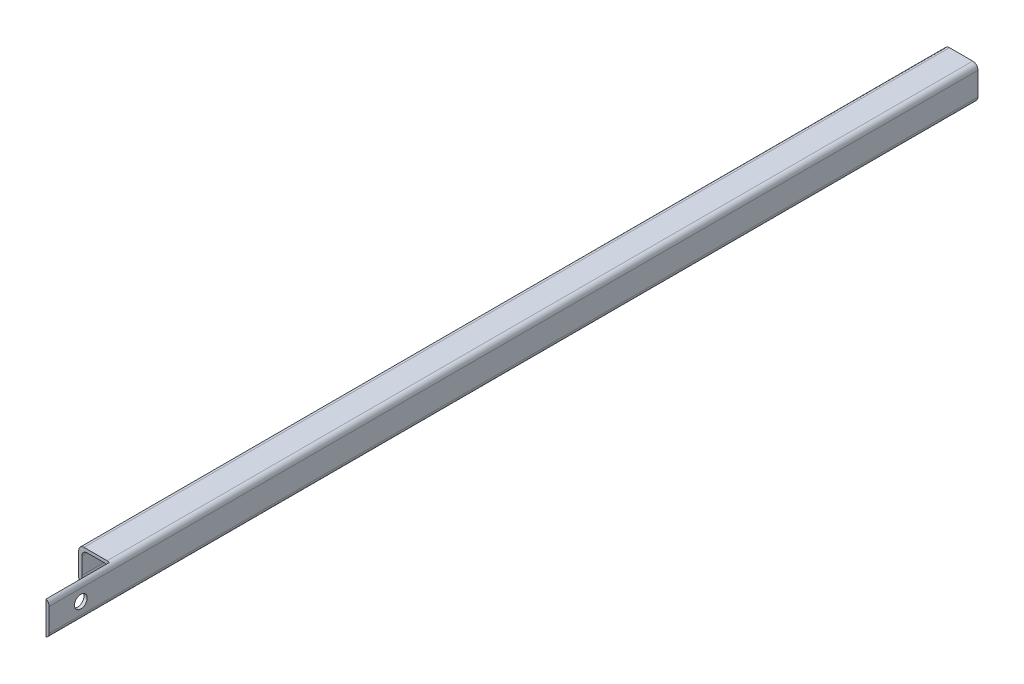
ISO-10303-21;
HEADER;
FILE_DESCRIPTION(('STEP AP214'),'2;1');
FILE_NAME('part.step','',(''),(''),'','','');
FILE_SCHEMA(('AUTOMOTIVE_DESIGN { 1 0 10303 214 1 1 1 1 }'));
ENDSEC;
DATA;
#1=APPLICATION_CONTEXT('core data for automotive mechanical design processes');
#2=APPLICATION_PROTOCOL_DEFINITION('international standard','automotive_design',2000,#1);
#3=PRODUCT_CONTEXT('',#1,'mechanical');
#4=PRODUCT('Part','Part','',(#3));
#5=PRODUCT_RELATED_PRODUCT_CATEGORY('part','',(#4));
#6=PRODUCT_DEFINITION_FORMATION('','',#4);
#7=PRODUCT_DEFINITION_CONTEXT('part definition',#1,'design');
#8=PRODUCT_DEFINITION('design','',#6,#7);
#9=PRODUCT_DEFINITION_SHAPE('','',#8);
#10=(LENGTH_UNIT() NAMED_UNIT(*) SI_UNIT(.MILLI.,.METRE.));
#11=(NAMED_UNIT(*) PLANE_ANGLE_UNIT() SI_UNIT($,.RADIAN.));
#12=(NAMED_UNIT(*) SI_UNIT($,.STERADIAN.) SOLID_ANGLE_UNIT());
#13=UNCERTAINTY_MEASURE_WITH_UNIT(LENGTH_MEASURE(1.E-05),#10,'distance_accuracy_value','');
#14=(GEOMETRIC_REPRESENTATION_CONTEXT(3) GLOBAL_UNCERTAINTY_ASSIGNED_CONTEXT((#13)) GLOBAL_UNIT_ASSIGNED_CONTEXT((#10,
#11,#12)) REPRESENTATION_CONTEXT('',''));
#15=CARTESIAN_POINT('',(0.,0.,0.));
#16=DIRECTION('',(0.,0.,1.));
#17=DIRECTION('',(1.,0.,0.));
#18=AXIS2_PLACEMENT_3D('',#15,#16,#17);
#19=CARTESIAN_POINT('',(7.99999999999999,-5.5,440.));
#20=DIRECTION('',(-1.,0.,0.));
#21=DIRECTION('',(0.,0.,1.));
#22=AXIS2_PLACEMENT_3D('',#19,#20,#21);
#23=PLANE('',#22);
#24=DIRECTION('',(0.,1.,0.));
#25=VECTOR('',#24,1.);
#26=CARTESIAN_POINT('',(7.99999999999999,-5.5,0.));
#27=LINE('',#26,#25);
#28=CARTESIAN_POINT('',(7.99999999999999,-5.5,0.));
#29=VERTEX_POINT('',#28);
#30=CARTESIAN_POINT('',(7.99999999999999,5.5,0.));
#31=VERTEX_POINT('',#30);
#32=EDGE_CURVE('E207',#29,#31,#27,.T.);
#33=ORIENTED_EDGE('',*,*,#32,.T.);
#34=DIRECTION('',(0.,0.,-1.));
#35=VECTOR('',#34,1.);
#36=CARTESIAN_POINT('',(7.99999999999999,5.5,440.));
#37=LINE('',#36,#35);
#38=CARTESIAN_POINT('',(7.99999999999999,5.5,440.));
#39=VERTEX_POINT('',#38);
#40=EDGE_CURVE('E186',#39,#31,#37,.T.);
#41=ORIENTED_EDGE('',*,*,#40,.F.);
#42=DIRECTION('',(0.,1.,0.));
#43=VECTOR('',#42,1.);
#44=CARTESIAN_POINT('',(7.99999999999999,-5.5,440.));
#45=LINE('',#44,#43);
#46=CARTESIAN_POINT('',(7.99999999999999,-5.5,440.));
#47=VERTEX_POINT('',#46);
#48=EDGE_CURVE('E196',#47,#39,#45,.T.);
#49=ORIENTED_EDGE('',*,*,#48,.F.);
#50=DIRECTION('',(0.,0.,-1.));
#51=VECTOR('',#50,1.);
#52=CARTESIAN_POINT('',(7.99999999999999,-5.5,440.));
#53=LINE('',#52,#51);
#54=EDGE_CURVE('E184',#47,#29,#53,.T.);
#55=ORIENTED_EDGE('',*,*,#54,.T.);
#56=EDGE_LOOP('',(#33,#41,#49,#55));
#57=FACE_BOUND('',#56,.T.);
#58=CARTESIAN_POINT('',(7.99999999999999,0.,425.));
#59=DIRECTION('',(1.,0.,0.));
#60=DIRECTION('',(0.,0.,-1.));
#61=AXIS2_PLACEMENT_3D('',#58,#59,#60);
#62=CIRCLE('',#61,2.99999999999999);
#63=CARTESIAN_POINT('',(7.99999999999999,0.,422.));
#64=VERTEX_POINT('',#63);
#65=EDGE_CURVE('E293',#64,#64,#62,.T.);
#66=ORIENTED_EDGE('',*,*,#65,.F.);
#67=EDGE_LOOP('',(#66));
#68=FACE_BOUND('',#67,.T.);
#69=ADVANCED_FACE('F28',(#57,#68),#23,.F.);
#70=CARTESIAN_POINT('',(6.49999999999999,-4.,440.));
#71=DIRECTION('',(-1.,0.,0.));
#72=DIRECTION('',(0.,0.,1.));
#73=AXIS2_PLACEMENT_3D('',#70,#71,#72);
#74=PLANE('',#73);
#75=DIRECTION('',(0.,1.,0.));
#76=VECTOR('',#75,1.);
#77=CARTESIAN_POINT('',(6.49999999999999,-8.,410.));
#78=LINE('',#77,#76);
#79=CARTESIAN_POINT('',(6.49999999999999,4.,410.));
#80=VERTEX_POINT('',#79);
#81=CARTESIAN_POINT('',(6.49999999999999,7.79128784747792,410.));
#82=VERTEX_POINT('',#81);
#83=EDGE_CURVE('E285',#80,#82,#78,.T.);
#84=ORIENTED_EDGE('',*,*,#83,.F.);
#85=DIRECTION('',(0.,0.,-1.));
#86=VECTOR('',#85,1.);
#87=CARTESIAN_POINT('',(6.49999999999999,4.,440.));
#88=LINE('',#87,#86);
#89=CARTESIAN_POINT('',(6.49999999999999,4.,0.));
#90=VERTEX_POINT('',#89);
#91=EDGE_CURVE('E231',#80,#90,#88,.T.);
#92=ORIENTED_EDGE('',*,*,#91,.T.);
#93=DIRECTION('',(0.,1.,0.));
#94=VECTOR('',#93,1.);
#95=CARTESIAN_POINT('',(6.49999999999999,-4.,0.));
#96=LINE('',#95,#94);
#97=CARTESIAN_POINT('',(6.49999999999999,-4.,0.));
#98=VERTEX_POINT('',#97);
#99=EDGE_CURVE('E243',#98,#90,#96,.T.);
#100=ORIENTED_EDGE('',*,*,#99,.F.);
#101=DIRECTION('',(0.,0.,-1.));
#102=VECTOR('',#101,1.);
#103=CARTESIAN_POINT('',(6.49999999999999,-4.,440.));
#104=LINE('',#103,#102);
#105=CARTESIAN_POINT('',(6.49999999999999,-4.,410.));
#106=VERTEX_POINT('',#105);
#107=EDGE_CURVE('E229',#106,#98,#104,.T.);
#108=ORIENTED_EDGE('',*,*,#107,.F.);
#109=CARTESIAN_POINT('',(6.49999999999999,-7.79128784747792,410.));
#110=VERTEX_POINT('',#109);
#111=EDGE_CURVE('E163',#110,#106,#78,.T.);
#112=ORIENTED_EDGE('',*,*,#111,.F.);
#113=DIRECTION('',(0.,0.,-1.));
#114=VECTOR('',#113,1.);
#115=CARTESIAN_POINT('',(6.49999999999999,-7.79128784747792,440.));
#116=LINE('',#115,#114);
#117=CARTESIAN_POINT('',(6.49999999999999,-7.79128784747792,440.));
#118=VERTEX_POINT('',#117);
#119=EDGE_CURVE('E261',#110,#118,#116,.F.);
#120=ORIENTED_EDGE('',*,*,#119,.T.);
#121=DIRECTION('',(0.,1.,0.));
#122=VECTOR('',#121,1.);
#123=CARTESIAN_POINT('',(6.49999999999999,-4.,440.));
#124=LINE('',#123,#122);
#125=CARTESIAN_POINT('',(6.49999999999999,7.79128784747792,440.));
#126=VERTEX_POINT('',#125);
#127=EDGE_CURVE('E236',#118,#126,#124,.T.);
#128=ORIENTED_EDGE('',*,*,#127,.T.);
#129=DIRECTION('',(0.,0.,-1.));
#130=VECTOR('',#129,1.);
#131=CARTESIAN_POINT('',(6.49999999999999,7.79128784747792,440.));
#132=LINE('',#131,#130);
#133=EDGE_CURVE('E264',#82,#126,#132,.F.);
#134=ORIENTED_EDGE('',*,*,#133,.F.);
#135=EDGE_LOOP('',(#84,#92,#100,#108,#112,#120,#128,#134));
#136=FACE_BOUND('',#135,.T.);
#137=CARTESIAN_POINT('',(6.49999999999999,0.,425.));
#138=DIRECTION('',(-1.,0.,0.));
#139=DIRECTION('',(0.,0.,1.));
#140=AXIS2_PLACEMENT_3D('',#137,#138,#139);
#141=CIRCLE('',#140,2.99999999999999);
#142=CARTESIAN_POINT('',(6.49999999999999,0.,428.));
#143=VERTEX_POINT('',#142);
#144=EDGE_CURVE('E32',#143,#143,#141,.F.);
#145=ORIENTED_EDGE('',*,*,#144,.T.);
#146=EDGE_LOOP('',(#145));
#147=FACE_BOUND('',#146,.T.);
#148=ADVANCED_FACE('F300',(#136,#147),#74,.T.);
#149=CARTESIAN_POINT('',(-5.5,5.5,440.));
#150=DIRECTION('',(0.,0.,-1.));
#151=DIRECTION('',(-1.,0.,0.));
#152=AXIS2_PLACEMENT_3D('',#149,#150,#151);
#153=CYLINDRICAL_SURFACE('',#152,2.5);
#154=CARTESIAN_POINT('',(-5.5,5.5,410.));
#155=DIRECTION('',(0.,0.,1.));
#156=DIRECTION('',(1.,0.,0.));
#157=AXIS2_PLACEMENT_3D('',#154,#155,#156);
#158=CIRCLE('',#157,2.5);
#159=CARTESIAN_POINT('',(-5.5,8.,410.));
#160=VERTEX_POINT('',#159);
#161=CARTESIAN_POINT('',(-8.,5.5,410.));
#162=VERTEX_POINT('',#161);
#163=EDGE_CURVE('E158',#160,#162,#158,.T.);
#164=ORIENTED_EDGE('',*,*,#163,.F.);
#165=DIRECTION('',(0.,0.,-1.));
#166=VECTOR('',#165,1.);
#167=CARTESIAN_POINT('',(-5.5,8.,440.));
#168=LINE('',#167,#166);
#169=CARTESIAN_POINT('',(-5.5,8.,0.));
#170=VERTEX_POINT('',#169);
#171=EDGE_CURVE('E191',#160,#170,#168,.T.);
#172=ORIENTED_EDGE('',*,*,#171,.T.);
#173=CARTESIAN_POINT('',(-5.5,5.5,0.));
#174=DIRECTION('',(0.,0.,1.));
#175=DIRECTION('',(1.,0.,0.));
#176=AXIS2_PLACEMENT_3D('',#173,#174,#175);
#177=CIRCLE('',#176,2.5);
#178=CARTESIAN_POINT('',(-8.,5.5,0.));
#179=VERTEX_POINT('',#178);
#180=EDGE_CURVE('E218',#170,#179,#177,.T.);
#181=ORIENTED_EDGE('',*,*,#180,.T.);
#182=DIRECTION('',(0.,0.,-1.));
#183=VECTOR('',#182,1.);
#184=CARTESIAN_POINT('',(-8.,5.5,440.));
#185=LINE('',#184,#183);
#186=EDGE_CURVE('E37',#162,#179,#185,.T.);
#187=ORIENTED_EDGE('',*,*,#186,.F.);
#188=EDGE_LOOP('',(#164,#172,#181,#187));
#189=FACE_BOUND('',#188,.T.);
#190=ADVANCED_FACE('F30',(#189),#153,.T.);
#191=CARTESIAN_POINT('',(-8.,5.5,440.));
#192=DIRECTION('',(1.,0.,0.));
#193=DIRECTION('',(0.,0.,-1.));
#194=AXIS2_PLACEMENT_3D('',#191,#192,#193);
#195=PLANE('',#194);
#196=DIRECTION('',(0.,1.,0.));
#197=VECTOR('',#196,1.);
#198=CARTESIAN_POINT('',(-8.,-8.,410.));
#199=LINE('',#198,#197);
#200=CARTESIAN_POINT('',(-8.,-5.5,410.));
#201=VERTEX_POINT('',#200);
#202=EDGE_CURVE('E152',#201,#162,#199,.T.);
#203=ORIENTED_EDGE('',*,*,#202,.T.);
#204=ORIENTED_EDGE('',*,*,#186,.T.);
#205=DIRECTION('',(0.,-1.,0.));
#206=VECTOR('',#205,1.);
#207=CARTESIAN_POINT('',(-8.,5.5,0.));
#208=LINE('',#207,#206);
#209=CARTESIAN_POINT('',(-8.,-5.5,0.));
#210=VERTEX_POINT('',#209);
#211=EDGE_CURVE('E176',#179,#210,#208,.T.);
#212=ORIENTED_EDGE('',*,*,#211,.T.);
#213=DIRECTION('',(0.,0.,-1.));
#214=VECTOR('',#213,1.);
#215=CARTESIAN_POINT('',(-8.,-5.5,440.));
#216=LINE('',#215,#214);
#217=EDGE_CURVE('E169',#201,#210,#216,.T.);
#218=ORIENTED_EDGE('',*,*,#217,.F.);
#219=EDGE_LOOP('',(#203,#204,#212,#218));
#220=FACE_BOUND('',#219,.T.);
#221=ADVANCED_FACE('F174',(#220),#195,.F.);
#222=CARTESIAN_POINT('',(-5.5,-5.5,440.));
#223=DIRECTION('',(0.,0.,-1.));
#224=DIRECTION('',(-1.,0.,0.));
#225=AXIS2_PLACEMENT_3D('',#222,#223,#224);
#226=CYLINDRICAL_SURFACE('',#225,2.5);
#227=DIRECTION('',(0.,0.,-1.));
#228=VECTOR('',#227,1.);
#229=CARTESIAN_POINT('',(-5.5,-8.,440.));
#230=LINE('',#229,#228);
#231=CARTESIAN_POINT('',(-5.5,-8.,410.));
#232=VERTEX_POINT('',#231);
#233=CARTESIAN_POINT('',(-5.5,-8.,0.));
#234=VERTEX_POINT('',#233);
#235=EDGE_CURVE('E171',#232,#234,#230,.T.);
#236=ORIENTED_EDGE('',*,*,#235,.F.);
#237=CARTESIAN_POINT('',(-5.5,-5.5,410.));
#238=DIRECTION('',(0.,0.,1.));
#239=DIRECTION('',(1.,0.,0.));
#240=AXIS2_PLACEMENT_3D('',#237,#238,#239);
#241=CIRCLE('',#240,2.5);
#242=EDGE_CURVE('E155',#232,#201,#241,.F.);
#243=ORIENTED_EDGE('',*,*,#242,.T.);
#244=ORIENTED_EDGE('',*,*,#217,.T.);
#245=CARTESIAN_POINT('',(-5.5,-5.5,0.));
#246=DIRECTION('',(0.,0.,-1.));
#247=DIRECTION('',(-1.,0.,0.));
#248=AXIS2_PLACEMENT_3D('',#245,#246,#247);
#249=CIRCLE('',#248,2.5);
#250=EDGE_CURVE('E215',#234,#210,#249,.T.);
#251=ORIENTED_EDGE('',*,*,#250,.F.);
#252=EDGE_LOOP('',(#236,#243,#244,#251));
#253=FACE_BOUND('',#252,.T.);
#254=ADVANCED_FACE('F167',(#253),#226,.T.);
#255=CARTESIAN_POINT('',(5.49999999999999,-8.,440.));
#256=DIRECTION('',(0.,-1.,0.));
#257=DIRECTION('',(0.,0.,-1.));
#258=AXIS2_PLACEMENT_3D('',#255,#256,#257);
#259=PLANE('',#258);
#260=DIRECTION('',(0.,0.,-1.));
#261=VECTOR('',#260,1.);
#262=CARTESIAN_POINT('',(5.49999999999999,-8.,440.));
#263=LINE('',#262,#261);
#264=CARTESIAN_POINT('',(5.49999999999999,-8.,410.));
#265=VERTEX_POINT('',#264);
#266=CARTESIAN_POINT('',(5.49999999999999,-8.,0.));
#267=VERTEX_POINT('',#266);
#268=EDGE_CURVE('E180',#265,#267,#263,.T.);
#269=ORIENTED_EDGE('',*,*,#268,.F.);
#270=DIRECTION('',(1.,0.,0.));
#271=VECTOR('',#270,1.);
#272=CARTESIAN_POINT('',(-8.,-8.,410.));
#273=LINE('',#272,#271);
#274=EDGE_CURVE('E287',#232,#265,#273,.T.);
#275=ORIENTED_EDGE('',*,*,#274,.F.);
#276=ORIENTED_EDGE('',*,*,#235,.T.);
#277=DIRECTION('',(-1.,0.,0.));
#278=VECTOR('',#277,1.);
#279=CARTESIAN_POINT('',(5.49999999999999,-8.,0.));
#280=LINE('',#279,#278);
#281=EDGE_CURVE('E212',#267,#234,#280,.T.);
#282=ORIENTED_EDGE('',*,*,#281,.F.);
#283=EDGE_LOOP('',(#269,#275,#276,#282));
#284=FACE_BOUND('',#283,.T.);
#285=ADVANCED_FACE('F327',(#284),#259,.T.);
#286=CARTESIAN_POINT('',(-5.5,8.,440.));
#287=DIRECTION('',(0.,1.,0.));
#288=DIRECTION('',(0.,0.,1.));
#289=AXIS2_PLACEMENT_3D('',#286,#287,#288);
#290=PLANE('',#289);
#291=ORIENTED_EDGE('',*,*,#171,.F.);
#292=DIRECTION('',(1.,0.,0.));
#293=VECTOR('',#292,1.);
#294=CARTESIAN_POINT('',(-8.,8.,410.));
#295=LINE('',#294,#293);
#296=CARTESIAN_POINT('',(5.49999999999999,8.,410.));
#297=VERTEX_POINT('',#296);
#298=EDGE_CURVE('E290',#160,#297,#295,.T.);
#299=ORIENTED_EDGE('',*,*,#298,.T.);
#300=DIRECTION('',(0.,0.,-1.));
#301=VECTOR('',#300,1.);
#302=CARTESIAN_POINT('',(5.49999999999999,8.,440.));
#303=LINE('',#302,#301);
#304=CARTESIAN_POINT('',(5.49999999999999,8.,0.));
#305=VERTEX_POINT('',#304);
#306=EDGE_CURVE('E189',#297,#305,#303,.T.);
#307=ORIENTED_EDGE('',*,*,#306,.T.);
#308=DIRECTION('',(1.,0.,0.));
#309=VECTOR('',#308,1.);
#310=CARTESIAN_POINT('',(-5.5,8.,0.));
#311=LINE('',#310,#309);
#312=EDGE_CURVE('E201',#170,#305,#311,.T.);
#313=ORIENTED_EDGE('',*,*,#312,.F.);
#314=EDGE_LOOP('',(#291,#299,#307,#313));
#315=FACE_BOUND('',#314,.T.);
#316=ADVANCED_FACE('F330',(#315),#290,.T.);
#317=CARTESIAN_POINT('',(-4.00000000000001,4.,440.));
#318=DIRECTION('',(0.,0.,-1.));
#319=DIRECTION('',(-1.,0.,0.));
#320=AXIS2_PLACEMENT_3D('',#317,#318,#319);
#321=CYLINDRICAL_SURFACE('',#320,2.5);
#322=DIRECTION('',(0.,0.,-1.));
#323=VECTOR('',#322,1.);
#324=CARTESIAN_POINT('',(-4.00000000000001,6.5,440.));
#325=LINE('',#324,#323);
#326=CARTESIAN_POINT('',(-4.00000000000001,6.5,410.));
#327=VERTEX_POINT('',#326);
#328=CARTESIAN_POINT('',(-4.00000000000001,6.5,0.));
#329=VERTEX_POINT('',#328);
#330=EDGE_CURVE('E50',#327,#329,#325,.T.);
#331=ORIENTED_EDGE('',*,*,#330,.F.);
#332=CARTESIAN_POINT('',(-4.00000000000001,4.,410.));
#333=DIRECTION('',(0.,0.,1.));
#334=DIRECTION('',(1.,0.,0.));
#335=AXIS2_PLACEMENT_3D('',#332,#333,#334);
#336=CIRCLE('',#335,2.5);
#337=CARTESIAN_POINT('',(-6.50000000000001,4.,410.));
#338=VERTEX_POINT('',#337);
#339=EDGE_CURVE('E43',#327,#338,#336,.T.);
#340=ORIENTED_EDGE('',*,*,#339,.T.);
#341=DIRECTION('',(0.,0.,-1.));
#342=VECTOR('',#341,1.);
#343=CARTESIAN_POINT('',(-6.50000000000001,4.,440.));
#344=LINE('',#343,#342);
#345=CARTESIAN_POINT('',(-6.50000000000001,4.,0.));
#346=VERTEX_POINT('',#345);
#347=EDGE_CURVE('E221',#338,#346,#344,.T.);
#348=ORIENTED_EDGE('',*,*,#347,.T.);
#349=CARTESIAN_POINT('',(-4.00000000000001,4.,0.));
#350=DIRECTION('',(0.,0.,1.));
#351=DIRECTION('',(1.,0.,0.));
#352=AXIS2_PLACEMENT_3D('',#349,#350,#351);
#353=CIRCLE('',#352,2.5);
#354=EDGE_CURVE('E258',#329,#346,#353,.T.);
#355=ORIENTED_EDGE('',*,*,#354,.F.);
#356=EDGE_LOOP('',(#331,#340,#348,#355));
#357=FACE_BOUND('',#356,.T.);
#358=ADVANCED_FACE('F377',(#357),#321,.F.);
#359=CARTESIAN_POINT('',(-6.50000000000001,4.,440.));
#360=DIRECTION('',(1.,0.,0.));
#361=DIRECTION('',(0.,0.,-1.));
#362=AXIS2_PLACEMENT_3D('',#359,#360,#361);
#363=PLANE('',#362);
#364=ORIENTED_EDGE('',*,*,#347,.F.);
#365=DIRECTION('',(0.,-1.,0.));
#366=VECTOR('',#365,1.);
#367=CARTESIAN_POINT('',(-6.50000000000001,4.,410.));
#368=LINE('',#367,#366);
#369=CARTESIAN_POINT('',(-6.50000000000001,-4.,410.));
#370=VERTEX_POINT('',#369);
#371=EDGE_CURVE('E279',#338,#370,#368,.T.);
#372=ORIENTED_EDGE('',*,*,#371,.T.);
#373=DIRECTION('',(0.,0.,-1.));
#374=VECTOR('',#373,1.);
#375=CARTESIAN_POINT('',(-6.50000000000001,-4.,440.));
#376=LINE('',#375,#374);
#377=CARTESIAN_POINT('',(-6.50000000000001,-4.,0.));
#378=VERTEX_POINT('',#377);
#379=EDGE_CURVE('E223',#370,#378,#376,.T.);
#380=ORIENTED_EDGE('',*,*,#379,.T.);
#381=DIRECTION('',(0.,-1.,0.));
#382=VECTOR('',#381,1.);
#383=CARTESIAN_POINT('',(-6.50000000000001,4.,0.));
#384=LINE('',#383,#382);
#385=EDGE_CURVE('E255',#346,#378,#384,.T.);
#386=ORIENTED_EDGE('',*,*,#385,.F.);
#387=EDGE_LOOP('',(#364,#372,#380,#386));
#388=FACE_BOUND('',#387,.T.);
#389=ADVANCED_FACE('F375',(#388),#363,.T.);
#390=CARTESIAN_POINT('',(-4.00000000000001,-4.,440.));
#391=DIRECTION('',(0.,0.,-1.));
#392=DIRECTION('',(-1.,0.,0.));
#393=AXIS2_PLACEMENT_3D('',#390,#391,#392);
#394=CYLINDRICAL_SURFACE('',#393,2.5);
#395=ORIENTED_EDGE('',*,*,#379,.F.);
#396=CARTESIAN_POINT('',(-4.00000000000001,-4.,410.));
#397=DIRECTION('',(0.,0.,1.));
#398=DIRECTION('',(1.,0.,0.));
#399=AXIS2_PLACEMENT_3D('',#396,#397,#398);
#400=CIRCLE('',#399,2.5);
#401=CARTESIAN_POINT('',(-4.00000000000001,-6.5,410.));
#402=VERTEX_POINT('',#401);
#403=EDGE_CURVE('E276',#370,#402,#400,.T.);
#404=ORIENTED_EDGE('',*,*,#403,.T.);
#405=DIRECTION('',(0.,0.,-1.));
#406=VECTOR('',#405,1.);
#407=CARTESIAN_POINT('',(-4.00000000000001,-6.5,440.));
#408=LINE('',#407,#406);
#409=CARTESIAN_POINT('',(-4.00000000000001,-6.5,0.));
#410=VERTEX_POINT('',#409);
#411=EDGE_CURVE('E225',#402,#410,#408,.T.);
#412=ORIENTED_EDGE('',*,*,#411,.T.);
#413=CARTESIAN_POINT('',(-4.00000000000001,-4.,0.));
#414=DIRECTION('',(0.,0.,1.));
#415=DIRECTION('',(1.,0.,0.));
#416=AXIS2_PLACEMENT_3D('',#413,#414,#415);
#417=CIRCLE('',#416,2.5);
#418=EDGE_CURVE('E252',#378,#410,#417,.T.);
#419=ORIENTED_EDGE('',*,*,#418,.F.);
#420=EDGE_LOOP('',(#395,#404,#412,#419));
#421=FACE_BOUND('',#420,.T.);
#422=ADVANCED_FACE('F370',(#421),#394,.F.);
#423=CARTESIAN_POINT('',(3.99999999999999,-6.5,440.));
#424=DIRECTION('',(0.,-1.,0.));
#425=DIRECTION('',(0.,0.,-1.));
#426=AXIS2_PLACEMENT_3D('',#423,#424,#425);
#427=PLANE('',#426);
#428=DIRECTION('',(-1.,0.,0.));
#429=VECTOR('',#428,1.);
#430=CARTESIAN_POINT('',(3.99999999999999,-6.5,410.));
#431=LINE('',#430,#429);
#432=CARTESIAN_POINT('',(3.99999999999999,-6.5,410.));
#433=VERTEX_POINT('',#432);
#434=EDGE_CURVE('E274',#433,#402,#431,.T.);
#435=ORIENTED_EDGE('',*,*,#434,.F.);
#436=DIRECTION('',(0.,0.,-1.));
#437=VECTOR('',#436,1.);
#438=CARTESIAN_POINT('',(3.99999999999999,-6.5,440.));
#439=LINE('',#438,#437);
#440=CARTESIAN_POINT('',(3.99999999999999,-6.5,0.));
#441=VERTEX_POINT('',#440);
#442=EDGE_CURVE('E227',#433,#441,#439,.T.);
#443=ORIENTED_EDGE('',*,*,#442,.T.);
#444=DIRECTION('',(-1.,0.,0.));
#445=VECTOR('',#444,1.);
#446=CARTESIAN_POINT('',(3.99999999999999,-6.5,0.));
#447=LINE('',#446,#445);
#448=EDGE_CURVE('E249',#441,#410,#447,.T.);
#449=ORIENTED_EDGE('',*,*,#448,.T.);
#450=ORIENTED_EDGE('',*,*,#411,.F.);
#451=EDGE_LOOP('',(#435,#443,#449,#450));
#452=FACE_BOUND('',#451,.T.);
#453=ADVANCED_FACE('F366',(#452),#427,.F.);
#454=CARTESIAN_POINT('',(3.99999999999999,-4.,440.));
#455=DIRECTION('',(0.,0.,-1.));
#456=DIRECTION('',(-1.,0.,0.));
#457=AXIS2_PLACEMENT_3D('',#454,#455,#456);
#458=CYLINDRICAL_SURFACE('',#457,2.5);
#459=CARTESIAN_POINT('',(3.99999999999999,-4.,410.));
#460=DIRECTION('',(0.,0.,1.));
#461=DIRECTION('',(1.,0.,0.));
#462=AXIS2_PLACEMENT_3D('',#459,#460,#461);
#463=CIRCLE('',#462,2.5);
#464=EDGE_CURVE('E272',#106,#433,#463,.F.);
#465=ORIENTED_EDGE('',*,*,#464,.F.);
#466=ORIENTED_EDGE('',*,*,#107,.T.);
#467=CARTESIAN_POINT('',(3.99999999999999,-4.,0.));
#468=DIRECTION('',(0.,0.,-1.));
#469=DIRECTION('',(-1.,0.,0.));
#470=AXIS2_PLACEMENT_3D('',#467,#468,#469);
#471=CIRCLE('',#470,2.5);
#472=EDGE_CURVE('E246',#98,#441,#471,.T.);
#473=ORIENTED_EDGE('',*,*,#472,.T.);
#474=ORIENTED_EDGE('',*,*,#442,.F.);
#475=EDGE_LOOP('',(#465,#466,#473,#474));
#476=FACE_BOUND('',#475,.T.);
#477=ADVANCED_FACE('F362',(#476),#458,.F.);
#478=CARTESIAN_POINT('',(3.99999999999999,4.,440.));
#479=DIRECTION('',(0.,0.,-1.));
#480=DIRECTION('',(-1.,0.,0.));
#481=AXIS2_PLACEMENT_3D('',#478,#479,#480);
#482=CYLINDRICAL_SURFACE('',#481,2.5);
#483=ORIENTED_EDGE('',*,*,#91,.F.);
#484=CARTESIAN_POINT('',(3.99999999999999,4.,410.));
#485=DIRECTION('',(0.,0.,1.));
#486=DIRECTION('',(1.,0.,0.));
#487=AXIS2_PLACEMENT_3D('',#484,#485,#486);
#488=CIRCLE('',#487,2.5);
#489=CARTESIAN_POINT('',(3.99999999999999,6.5,410.));
#490=VERTEX_POINT('',#489);
#491=EDGE_CURVE('E162',#80,#490,#488,.T.);
#492=ORIENTED_EDGE('',*,*,#491,.T.);
#493=DIRECTION('',(0.,0.,-1.));
#494=VECTOR('',#493,1.);
#495=CARTESIAN_POINT('',(3.99999999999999,6.5,440.));
#496=LINE('',#495,#494);
#497=CARTESIAN_POINT('',(3.99999999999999,6.5,0.));
#498=VERTEX_POINT('',#497);
#499=EDGE_CURVE('E233',#490,#498,#496,.T.);
#500=ORIENTED_EDGE('',*,*,#499,.T.);
#501=CARTESIAN_POINT('',(3.99999999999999,4.,0.));
#502=DIRECTION('',(0.,0.,1.));
#503=DIRECTION('',(1.,0.,0.));
#504=AXIS2_PLACEMENT_3D('',#501,#502,#503);
#505=CIRCLE('',#504,2.5);
#506=EDGE_CURVE('E240',#90,#498,#505,.T.);
#507=ORIENTED_EDGE('',*,*,#506,.F.);
#508=EDGE_LOOP('',(#483,#492,#500,#507));
#509=FACE_BOUND('',#508,.T.);
#510=ADVANCED_FACE('F384',(#509),#482,.F.);
#511=CARTESIAN_POINT('',(-4.00000000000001,6.5,440.));
#512=DIRECTION('',(0.,1.,0.));
#513=DIRECTION('',(0.,0.,1.));
#514=AXIS2_PLACEMENT_3D('',#511,#512,#513);
#515=PLANE('',#514);
#516=DIRECTION('',(1.,0.,0.));
#517=VECTOR('',#516,1.);
#518=CARTESIAN_POINT('',(-4.00000000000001,6.5,410.));
#519=LINE('',#518,#517);
#520=EDGE_CURVE('E11',#327,#490,#519,.T.);
#521=ORIENTED_EDGE('',*,*,#520,.F.);
#522=ORIENTED_EDGE('',*,*,#330,.T.);
#523=DIRECTION('',(1.,0.,0.));
#524=VECTOR('',#523,1.);
#525=CARTESIAN_POINT('',(-4.00000000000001,6.5,0.));
#526=LINE('',#525,#524);
#527=EDGE_CURVE('E238',#329,#498,#526,.T.);
#528=ORIENTED_EDGE('',*,*,#527,.T.);
#529=ORIENTED_EDGE('',*,*,#499,.F.);
#530=EDGE_LOOP('',(#521,#522,#528,#529));
#531=FACE_BOUND('',#530,.T.);
#532=ADVANCED_FACE('F381',(#531),#515,.F.);
#533=CARTESIAN_POINT('',(-5.5,5.5,440.));
#534=DIRECTION('',(0.,0.,1.));
#535=DIRECTION('',(1.,0.,0.));
#536=AXIS2_PLACEMENT_3D('',#533,#534,#535);
#537=PLANE('',#536);
#538=ORIENTED_EDGE('',*,*,#127,.F.);
#539=CARTESIAN_POINT('',(5.49999999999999,-5.5,440.));
#540=DIRECTION('',(0.,0.,-1.));
#541=DIRECTION('',(-1.,0.,0.));
#542=AXIS2_PLACEMENT_3D('',#539,#540,#541);
#543=CIRCLE('',#542,2.5);
#544=EDGE_CURVE('E198',#47,#118,#543,.T.);
#545=ORIENTED_EDGE('',*,*,#544,.F.);
#546=ORIENTED_EDGE('',*,*,#48,.T.);
#547=CARTESIAN_POINT('',(5.49999999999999,5.5,440.));
#548=DIRECTION('',(0.,0.,1.));
#549=DIRECTION('',(1.,0.,0.));
#550=AXIS2_PLACEMENT_3D('',#547,#548,#549);
#551=CIRCLE('',#550,2.5);
#552=EDGE_CURVE('E193',#39,#126,#551,.T.);
#553=ORIENTED_EDGE('',*,*,#552,.T.);
#554=EDGE_LOOP('',(#538,#545,#546,#553));
#555=FACE_BOUND('',#554,.T.);
#556=ADVANCED_FACE('F389',(#555),#537,.T.);
#557=CARTESIAN_POINT('',(-5.5,5.5,0.));
#558=DIRECTION('',(0.,0.,1.));
#559=DIRECTION('',(1.,0.,0.));
#560=AXIS2_PLACEMENT_3D('',#557,#558,#559);
#561=PLANE('',#560);
#562=ORIENTED_EDGE('',*,*,#180,.F.);
#563=ORIENTED_EDGE('',*,*,#312,.T.);
#564=CARTESIAN_POINT('',(5.49999999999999,5.5,0.));
#565=DIRECTION('',(0.,0.,1.));
#566=DIRECTION('',(1.,0.,0.));
#567=AXIS2_PLACEMENT_3D('',#564,#565,#566);
#568=CIRCLE('',#567,2.5);
#569=EDGE_CURVE('E204',#31,#305,#568,.T.);
#570=ORIENTED_EDGE('',*,*,#569,.F.);
#571=ORIENTED_EDGE('',*,*,#32,.F.);
#572=CARTESIAN_POINT('',(5.49999999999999,-5.5,0.));
#573=DIRECTION('',(0.,0.,-1.));
#574=DIRECTION('',(-1.,0.,0.));
#575=AXIS2_PLACEMENT_3D('',#572,#573,#574);
#576=CIRCLE('',#575,2.5);
#577=EDGE_CURVE('E209',#29,#267,#576,.T.);
#578=ORIENTED_EDGE('',*,*,#577,.T.);
#579=ORIENTED_EDGE('',*,*,#281,.T.);
#580=ORIENTED_EDGE('',*,*,#250,.T.);
#581=ORIENTED_EDGE('',*,*,#211,.F.);
#582=EDGE_LOOP('',(#562,#563,#570,#571,#578,#579,#580,#581));
#583=FACE_BOUND('',#582,.T.);
#584=ORIENTED_EDGE('',*,*,#354,.T.);
#585=ORIENTED_EDGE('',*,*,#385,.T.);
#586=ORIENTED_EDGE('',*,*,#418,.T.);
#587=ORIENTED_EDGE('',*,*,#448,.F.);
#588=ORIENTED_EDGE('',*,*,#472,.F.);
#589=ORIENTED_EDGE('',*,*,#99,.T.);
#590=ORIENTED_EDGE('',*,*,#506,.T.);
#591=ORIENTED_EDGE('',*,*,#527,.F.);
#592=EDGE_LOOP('',(#584,#585,#586,#587,#588,#589,#590,#591));
#593=FACE_BOUND('',#592,.T.);
#594=ADVANCED_FACE('F325',(#583,#593),#561,.F.);
#595=CARTESIAN_POINT('',(5.49999999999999,-5.5,440.));
#596=DIRECTION('',(0.,0.,-1.));
#597=DIRECTION('',(-1.,0.,0.));
#598=AXIS2_PLACEMENT_3D('',#595,#596,#597);
#599=CYLINDRICAL_SURFACE('',#598,2.5);
#600=ORIENTED_EDGE('',*,*,#119,.F.);
#601=CARTESIAN_POINT('',(5.49999999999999,-5.5,410.));
#602=DIRECTION('',(0.,0.,1.));
#603=DIRECTION('',(1.,0.,0.));
#604=AXIS2_PLACEMENT_3D('',#601,#602,#603);
#605=CIRCLE('',#604,2.5);
#606=EDGE_CURVE('E172',#110,#265,#605,.F.);
#607=ORIENTED_EDGE('',*,*,#606,.T.);
#608=ORIENTED_EDGE('',*,*,#268,.T.);
#609=ORIENTED_EDGE('',*,*,#577,.F.);
#610=ORIENTED_EDGE('',*,*,#54,.F.);
#611=ORIENTED_EDGE('',*,*,#544,.T.);
#612=EDGE_LOOP('',(#600,#607,#608,#609,#610,#611));
#613=FACE_BOUND('',#612,.T.);
#614=ADVANCED_FACE('F322',(#613),#599,.T.);
#615=CARTESIAN_POINT('',(5.49999999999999,5.5,440.));
#616=DIRECTION('',(0.,0.,-1.));
#617=DIRECTION('',(-1.,0.,0.));
#618=AXIS2_PLACEMENT_3D('',#615,#616,#617);
#619=CYLINDRICAL_SURFACE('',#618,2.5);
#620=CARTESIAN_POINT('',(5.49999999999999,5.5,410.));
#621=DIRECTION('',(0.,0.,1.));
#622=DIRECTION('',(1.,0.,0.));
#623=AXIS2_PLACEMENT_3D('',#620,#621,#622);
#624=CIRCLE('',#623,2.5);
#625=EDGE_CURVE('E270',#82,#297,#624,.T.);
#626=ORIENTED_EDGE('',*,*,#625,.F.);
#627=ORIENTED_EDGE('',*,*,#133,.T.);
#628=ORIENTED_EDGE('',*,*,#552,.F.);
#629=ORIENTED_EDGE('',*,*,#40,.T.);
#630=ORIENTED_EDGE('',*,*,#569,.T.);
#631=ORIENTED_EDGE('',*,*,#306,.F.);
#632=EDGE_LOOP('',(#626,#627,#628,#629,#630,#631));
#633=FACE_BOUND('',#632,.T.);
#634=ADVANCED_FACE('F308',(#633),#619,.T.);
#635=CARTESIAN_POINT('',(-8.,-8.,410.));
#636=DIRECTION('',(0.,0.,1.));
#637=DIRECTION('',(1.,0.,0.));
#638=AXIS2_PLACEMENT_3D('',#635,#636,#637);
#639=PLANE('',#638);
#640=ORIENTED_EDGE('',*,*,#163,.T.);
#641=ORIENTED_EDGE('',*,*,#202,.F.);
#642=ORIENTED_EDGE('',*,*,#242,.F.);
#643=ORIENTED_EDGE('',*,*,#274,.T.);
#644=ORIENTED_EDGE('',*,*,#606,.F.);
#645=ORIENTED_EDGE('',*,*,#111,.T.);
#646=ORIENTED_EDGE('',*,*,#464,.T.);
#647=ORIENTED_EDGE('',*,*,#434,.T.);
#648=ORIENTED_EDGE('',*,*,#403,.F.);
#649=ORIENTED_EDGE('',*,*,#371,.F.);
#650=ORIENTED_EDGE('',*,*,#339,.F.);
#651=ORIENTED_EDGE('',*,*,#520,.T.);
#652=ORIENTED_EDGE('',*,*,#491,.F.);
#653=ORIENTED_EDGE('',*,*,#83,.T.);
#654=ORIENTED_EDGE('',*,*,#625,.T.);
#655=ORIENTED_EDGE('',*,*,#298,.F.);
#656=EDGE_LOOP('',(#640,#641,#642,#643,#644,#645,#646,#647,#648,#649,#650,#651,#652,#653,#654,#655));
#657=FACE_BOUND('',#656,.T.);
#658=ADVANCED_FACE('F154',(#657),#639,.T.);
#659=CARTESIAN_POINT('',(7.99999999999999,0.,425.));
#660=DIRECTION('',(-1.,0.,0.));
#661=DIRECTION('',(0.,0.,1.));
#662=AXIS2_PLACEMENT_3D('',#659,#660,#661);
#663=CYLINDRICAL_SURFACE('',#662,2.99999999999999);
#664=ORIENTED_EDGE('',*,*,#144,.F.);
#665=EDGE_LOOP('',(#664));
#666=FACE_BOUND('',#665,.T.);
#667=ORIENTED_EDGE('',*,*,#65,.T.);
#668=EDGE_LOOP('',(#667));
#669=FACE_BOUND('',#668,.T.);
#670=ADVANCED_FACE('F302',(#666,#669),#663,.F.);
#671=CLOSED_SHELL('',(#69,#148,#190,#221,#254,#285,#316,#358,#389,#422,#453,#477,#510,#532,#556,
#594,#614,#634,#658,#670));
#672=MANIFOLD_SOLID_BREP('B2',#671);
#673=ADVANCED_BREP_SHAPE_REPRESENTATION('',(#18,#672),#14);
#674=SHAPE_DEFINITION_REPRESENTATION(#9,#673);
ENDSEC;
END-ISO-10303-21;
